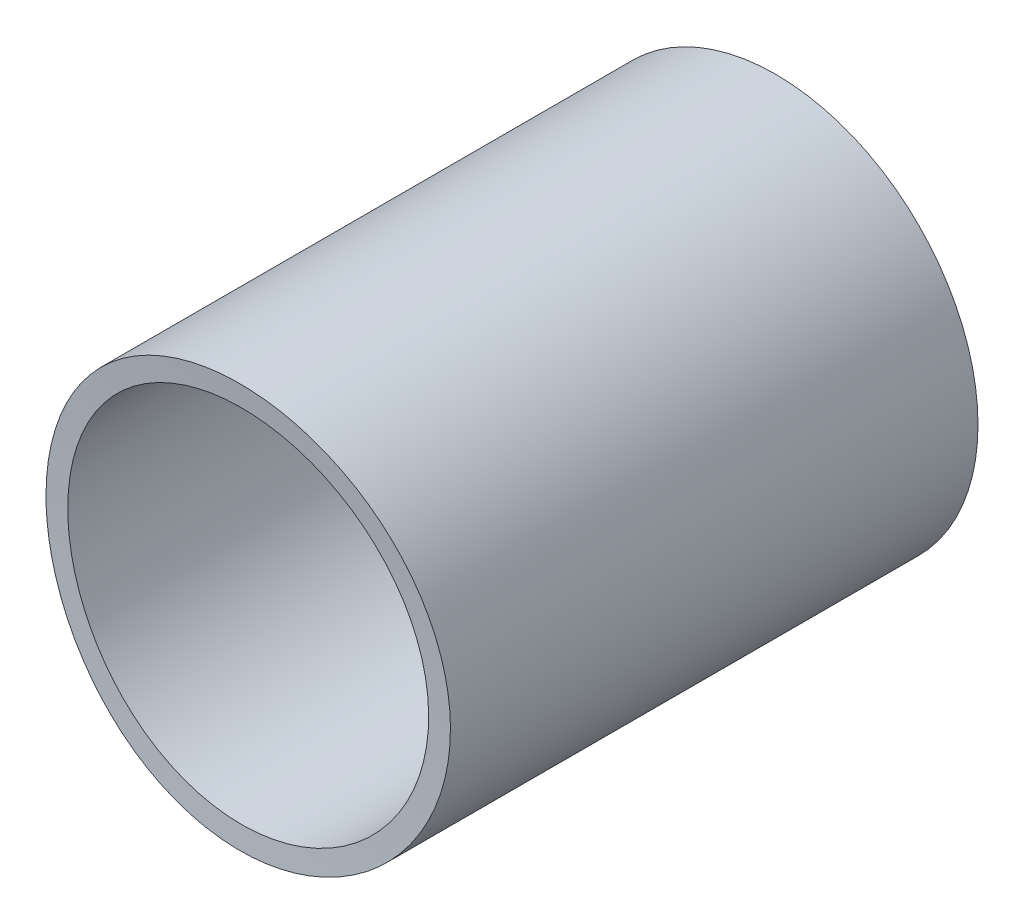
from build123d import *

# Parameters (mm, degrees)
ESQUISSE1_R             = 24.15
ESQUISSE1_R_2           = 21.55
EXTRU_MINCE1_DEPTH      = 652.999998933
ESQUISSE2_R             = 295
ENL_V_MAT_EXTRU_1_DEPTH = 540


with BuildPart() as part:
    # Esquisse1 → Extru.-Mince1 (new body)
    with BuildSketch(Plane.XY.offset(-8)):
        with Locations((-500, 0)):
            Circle(ESQUISSE1_R)
        with Locations((-500, 0)):
            Circle(ESQUISSE1_R_2, mode=Mode.SUBTRACT)
    extrude(amount=EXTRU_MINCE1_DEPTH)

    # Esquisse2 → Enl_v. mat.-Extru.1 (cut)
    with BuildSketch(Plane(origin=(0, 0, 0), x_dir=(0, 0, -1), z_dir=(1, 0, 0))):
        with Locations((-350, 0)):
            Circle(ESQUISSE2_R)
    extrude(amount=-ENL_V_MAT_EXTRU_1_DEPTH, mode=Mode.SUBTRACT)


solid = part.part
